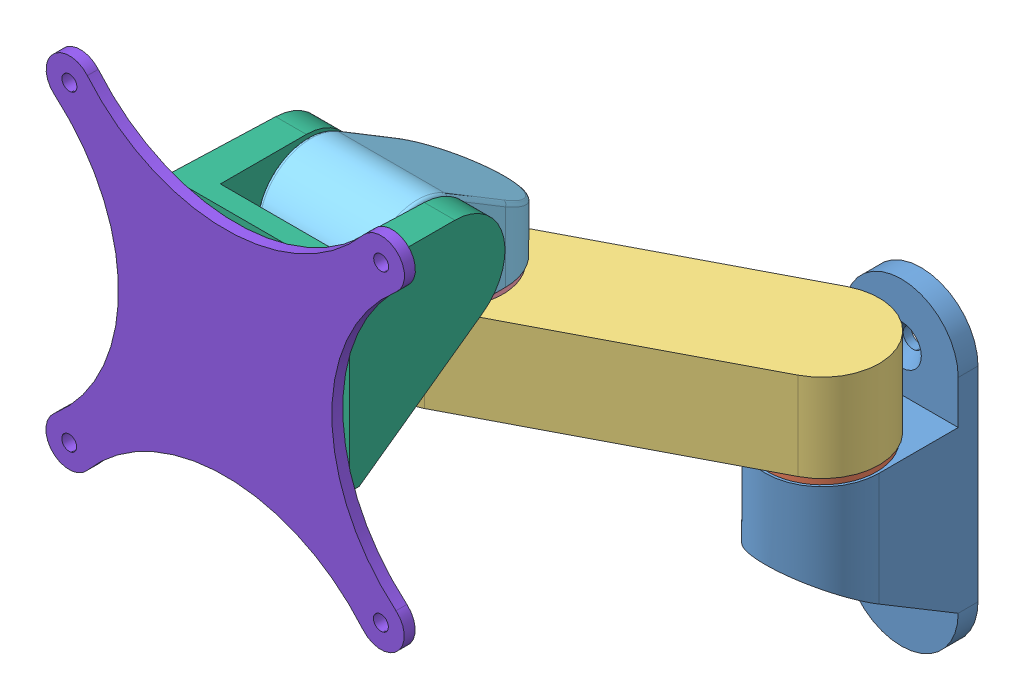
SolidWorks assembly Wall Mount Arm, VESA-WALLMT3-BLK.SLDASM, configuration Default (file format 10000). Lengths in mm.
Overall size (161.02 168.68 144.51).
8 component instances, 8 part files, 14 mates.
Components (placement in the parent):
- 703128 Gen Ref-1: 703128 Gen Ref.sldprt [Default] x (0 0 -1) z (1 0 0) size (50.01 102.06 36.53)
- 704139 Gen Ref-1: 704139 Gen Ref.sldprt [Default] at (18.2626 29.2735 7.1374) x (1 0 0) z (0 -1 0) size (34.95 34.95 2.29)
- 754440 Gen Ref-1: 754440 Gen Ref.sldprt [Default] at (-60.5862 29.2735 48.1992) x (-0.886939 0 0.461887) z (0 1 0) size (125.48 36.58 28.17)
- 703072 Gen Ref-1: 703072 Gen Ref.sldprt [Default] at (-60.5862 58.5851 48.1992) x (0.99794 0 0.064149) z (0 1 0) size (34.95 34.95 2.29)
- 704060 Gen Ref-1: 704060 Gen Ref.sldprt [Default] at (-60.5862 80.3529 75.1994) x (0 0 1) z (-1 0 0) size (62.07 37.29 36.52)
- 704133 Gen Ref-1: 704133 Gen Ref.sldprt [Default] at (-60.5862 97.6396 109.3239) x (1 0 0) z (0 1 -0.000759) size (58.73 50.8 58.73)
- 701161 Gen Ref-1: 701161 Gen Ref.sldprt [Default] at (-60.5862 68.2826 116.3565) x (-1 0 0) z (0 -0.000759 -1) size (62.46 62.46 7.01)
- 105587 Gen Ref-1: 105587 Gen Ref.sldprt [Default] at (-60.5862 68.2852 119.8567) x (1 0 0) z (0 0.000759 1) size (115.01 115.01 3.5)
Mates (geometry in assembly coordinates):
- Coincident2: coincident anti-aligned: line of 704133 Gen Ref-1 through (-60.5862 68.2772 109.3461) axis (0 0.000759 1); line of 701161 Gen Ref-1 through (-60.5862 68.2826 116.3565) axis (0 -0.000759 -1)
- Coincident3: coincident anti-aligned: plane of 704133 Gen Ref-1 through (-89.9486 97.6396 109.3239) normal (0 0.000759 1); plane of 701161 Gen Ref-1 through (-60.5862 68.2772 109.3461) normal (0 -0.000759 -1)
- Concentric1: concentric anti-aligned: cylinder of 704060 Gen Ref-1 through (-60.5862 80.3529 75.1994) axis (-1 0 0) radius 16.6624; cylinder of 704133 Gen Ref-1 through (-60.5862 80.3529 75.1994) axis (1 0 0) radius 16.6624
- Width1: width aligned: plane of 704133 Gen Ref-1 through (-79.0151 97.6348 102.9739) normal (0.999848 -0.000013 -0.017452); plane of 704133 Gen Ref-1 through (-41.3738 97.4899 58.0794) normal (-0.999848 -0.000013 -0.017452); plane of 704060 Gen Ref-1 through (-78.8361 76.5391 61.7139) normal (-1 0 0); plane of 704060 Gen Ref-1 through (-42.3363 76.5391 61.7139) normal (1 0 0)
- Coincident4: coincident anti-aligned: plane of 703072 Gen Ref-1 through (-60.5862 59.7281 48.1992) normal (0 1 0); plane of 704060 Gen Ref-1 through (-60.5862 59.7281 57.6887) normal (0 -1 0)
- Concentric2: concentric aligned: circle of 703072 Gen Ref-1; circle of 704060 Gen Ref-1
- Coincident5: coincident anti-aligned: plane of 754440 Gen Ref-1 through (-21.1618 57.4421 27.6683) normal (0 1 0); plane of 703072 Gen Ref-1 through (-60.5862 57.4421 48.1992) normal (0 -1 0)
- Concentric3: concentric aligned: circle of 754440 Gen Ref-1; circle of 703072 Gen Ref-1
- Coincident6: coincident anti-aligned: plane of 704139 Gen Ref-1 through (18.2626 29.2735 7.1374) normal (0 1 0); plane of 754440 Gen Ref-1 through (-21.1618 29.2735 27.6683) normal (0 -1 0)
- Concentric4: concentric aligned: circle of 704139 Gen Ref-1; circle of 754440 Gen Ref-1
- Coincident7: coincident anti-aligned: plane of 703128 Gen Ref-1 through (0 26.9875 25.4) normal (0 1 0); plane of 704139 Gen Ref-1 through (18.2626 26.9875 7.1374) normal (0 -1 0)
- Concentric5: concentric anti-aligned: circle of 703128 Gen Ref-1; circle of 704139 Gen Ref-1
- Coincident8: coincident anti-aligned: plane of 701161 Gen Ref-1 through (-60.5862 68.2826 116.3565) normal (0 0.000759 1); plane of 105587 Gen Ref-1 through (-60.5862 68.2826 116.3565) normal (0 -0.000759 -1)
- Coincident9: coincident aligned: line of 704133 Gen Ref-1 through (-60.5862 68.2772 109.3461) axis (0 0.000759 1); line of 105587 Gen Ref-1 through (-60.5862 68.2852 119.8567) axis (0 0.000759 1)
